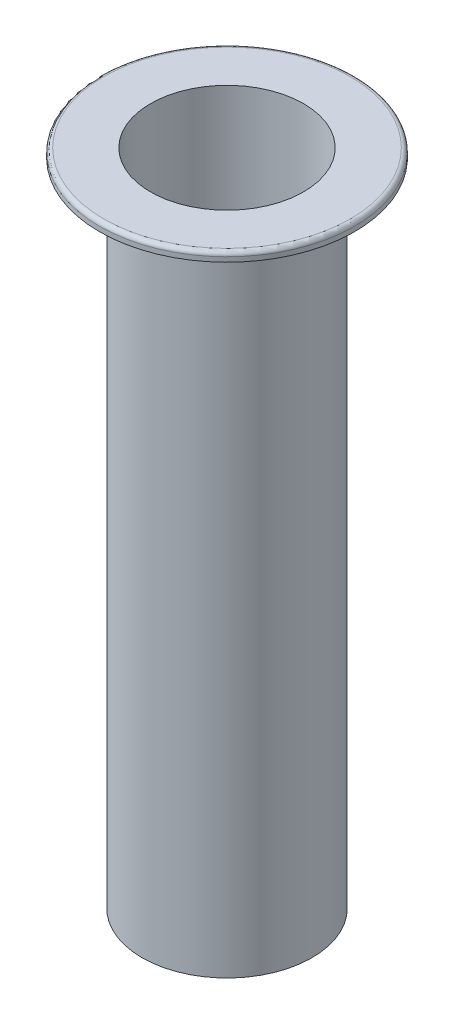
ISO-10303-21;
HEADER;
FILE_DESCRIPTION(('STEP AP214'),'2;1');
FILE_NAME('part.step','',(''),(''),'','','');
FILE_SCHEMA(('AUTOMOTIVE_DESIGN { 1 0 10303 214 1 1 1 1 }'));
ENDSEC;
DATA;
#1=APPLICATION_CONTEXT('core data for automotive mechanical design processes');
#2=APPLICATION_PROTOCOL_DEFINITION('international standard','automotive_design',2000,#1);
#3=PRODUCT_CONTEXT('',#1,'mechanical');
#4=PRODUCT('Part','Part','',(#3));
#5=PRODUCT_RELATED_PRODUCT_CATEGORY('part','',(#4));
#6=PRODUCT_DEFINITION_FORMATION('','',#4);
#7=PRODUCT_DEFINITION_CONTEXT('part definition',#1,'design');
#8=PRODUCT_DEFINITION('design','',#6,#7);
#9=PRODUCT_DEFINITION_SHAPE('','',#8);
#10=(LENGTH_UNIT() NAMED_UNIT(*) SI_UNIT(.MILLI.,.METRE.));
#11=(NAMED_UNIT(*) PLANE_ANGLE_UNIT() SI_UNIT($,.RADIAN.));
#12=(NAMED_UNIT(*) SI_UNIT($,.STERADIAN.) SOLID_ANGLE_UNIT());
#13=UNCERTAINTY_MEASURE_WITH_UNIT(LENGTH_MEASURE(1.E-05),#10,'distance_accuracy_value','');
#14=(GEOMETRIC_REPRESENTATION_CONTEXT(3) GLOBAL_UNCERTAINTY_ASSIGNED_CONTEXT((#13)) GLOBAL_UNIT_ASSIGNED_CONTEXT((#10,
#11,#12)) REPRESENTATION_CONTEXT('',''));
#15=CARTESIAN_POINT('',(0.,0.,0.));
#16=DIRECTION('',(0.,0.,1.));
#17=DIRECTION('',(1.,0.,0.));
#18=AXIS2_PLACEMENT_3D('',#15,#16,#17);
#19=CARTESIAN_POINT('',(0.,-150.,0.));
#20=DIRECTION('',(0.,1.,0.));
#21=DIRECTION('',(0.,0.,1.));
#22=AXIS2_PLACEMENT_3D('',#19,#20,#21);
#23=CYLINDRICAL_SURFACE('',#22,20.);
#24=CARTESIAN_POINT('',(0.,-150.,0.));
#25=DIRECTION('',(0.,1.,0.));
#26=DIRECTION('',(0.,0.,1.));
#27=AXIS2_PLACEMENT_3D('',#24,#25,#26);
#28=CIRCLE('',#27,20.);
#29=CARTESIAN_POINT('',(0.,-150.,20.));
#30=VERTEX_POINT('',#29);
#31=EDGE_CURVE('E52',#30,#30,#28,.T.);
#32=ORIENTED_EDGE('',*,*,#31,.T.);
#33=EDGE_LOOP('',(#32));
#34=FACE_BOUND('',#33,.T.);
#35=CARTESIAN_POINT('',(0.,0.,0.));
#36=DIRECTION('',(0.,1.,0.));
#37=DIRECTION('',(0.,0.,1.));
#38=AXIS2_PLACEMENT_3D('',#35,#36,#37);
#39=CIRCLE('',#38,20.);
#40=CARTESIAN_POINT('',(0.,0.,20.));
#41=VERTEX_POINT('',#40);
#42=EDGE_CURVE('E53',#41,#41,#39,.T.);
#43=ORIENTED_EDGE('',*,*,#42,.F.);
#44=EDGE_LOOP('',(#43));
#45=FACE_BOUND('',#44,.T.);
#46=ADVANCED_FACE('F32',(#34,#45),#23,.T.);
#47=CARTESIAN_POINT('',(0.,-150.,0.));
#48=DIRECTION('',(0.,1.,0.));
#49=DIRECTION('',(0.,0.,1.));
#50=AXIS2_PLACEMENT_3D('',#47,#48,#49);
#51=PLANE('',#50);
#52=CARTESIAN_POINT('',(0.,-150.,0.));
#53=DIRECTION('',(0.,-1.,0.));
#54=DIRECTION('',(0.,0.,-1.));
#55=AXIS2_PLACEMENT_3D('',#52,#53,#54);
#56=CIRCLE('',#55,18.);
#57=CARTESIAN_POINT('',(0.,-150.,-18.));
#58=VERTEX_POINT('',#57);
#59=EDGE_CURVE('E59',#58,#58,#56,.T.);
#60=ORIENTED_EDGE('',*,*,#59,.F.);
#61=EDGE_LOOP('',(#60));
#62=FACE_BOUND('',#61,.T.);
#63=ORIENTED_EDGE('',*,*,#31,.F.);
#64=EDGE_LOOP('',(#63));
#65=FACE_BOUND('',#64,.T.);
#66=ADVANCED_FACE('F75',(#62,#65),#51,.F.);
#67=CARTESIAN_POINT('',(0.,5.,0.));
#68=DIRECTION('',(0.,-1.,0.));
#69=DIRECTION('',(0.,0.,-1.));
#70=AXIS2_PLACEMENT_3D('',#67,#68,#69);
#71=CYLINDRICAL_SURFACE('',#70,30.);
#72=CARTESIAN_POINT('',(0.,4.,0.));
#73=DIRECTION('',(0.,1.,0.));
#74=DIRECTION('',(0.,0.,1.));
#75=AXIS2_PLACEMENT_3D('',#72,#73,#74);
#76=CIRCLE('',#75,30.);
#77=CARTESIAN_POINT('',(0.,4.,30.));
#78=VERTEX_POINT('',#77);
#79=EDGE_CURVE('E10',#78,#78,#76,.F.);
#80=ORIENTED_EDGE('',*,*,#79,.T.);
#81=EDGE_LOOP('',(#80));
#82=FACE_BOUND('',#81,.T.);
#83=CARTESIAN_POINT('',(0.,2.88675134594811,0.));
#84=DIRECTION('',(0.,1.,0.));
#85=DIRECTION('',(0.,0.,1.));
#86=AXIS2_PLACEMENT_3D('',#83,#84,#85);
#87=CIRCLE('',#86,30.);
#88=CARTESIAN_POINT('',(0.,2.88675134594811,30.));
#89=VERTEX_POINT('',#88);
#90=EDGE_CURVE('E47',#89,#89,#87,.T.);
#91=ORIENTED_EDGE('',*,*,#90,.T.);
#92=EDGE_LOOP('',(#91));
#93=FACE_BOUND('',#92,.T.);
#94=ADVANCED_FACE('F78',(#82,#93),#71,.T.);
#95=CARTESIAN_POINT('',(0.,5.,0.));
#96=DIRECTION('',(0.,1.,0.));
#97=DIRECTION('',(0.,0.,1.));
#98=AXIS2_PLACEMENT_3D('',#95,#96,#97);
#99=PLANE('',#98);
#100=CARTESIAN_POINT('',(0.,5.,0.));
#101=DIRECTION('',(0.,1.,0.));
#102=DIRECTION('',(0.,0.,1.));
#103=AXIS2_PLACEMENT_3D('',#100,#101,#102);
#104=CIRCLE('',#103,29.);
#105=CARTESIAN_POINT('',(0.,5.,29.));
#106=VERTEX_POINT('',#105);
#107=EDGE_CURVE('E39',#106,#106,#104,.T.);
#108=ORIENTED_EDGE('',*,*,#107,.T.);
#109=EDGE_LOOP('',(#108));
#110=FACE_BOUND('',#109,.T.);
#111=CARTESIAN_POINT('',(0.,5.,0.));
#112=DIRECTION('',(0.,-1.,0.));
#113=DIRECTION('',(0.,0.,-1.));
#114=AXIS2_PLACEMENT_3D('',#111,#112,#113);
#115=CIRCLE('',#114,18.);
#116=CARTESIAN_POINT('',(0.,5.,-18.));
#117=VERTEX_POINT('',#116);
#118=EDGE_CURVE('E56',#117,#117,#115,.T.);
#119=ORIENTED_EDGE('',*,*,#118,.T.);
#120=EDGE_LOOP('',(#119));
#121=FACE_BOUND('',#120,.T.);
#122=ADVANCED_FACE('F65',(#110,#121),#99,.T.);
#123=CARTESIAN_POINT('',(0.,0.,0.));
#124=DIRECTION('',(0.,1.,0.));
#125=DIRECTION('',(0.,0.,1.));
#126=AXIS2_PLACEMENT_3D('',#123,#124,#125);
#127=PLANE('',#126);
#128=CARTESIAN_POINT('',(0.,0.,0.));
#129=DIRECTION('',(0.,1.,0.));
#130=DIRECTION('',(0.,0.,1.));
#131=AXIS2_PLACEMENT_3D('',#128,#129,#130);
#132=CIRCLE('',#131,25.);
#133=CARTESIAN_POINT('',(0.,0.,25.));
#134=VERTEX_POINT('',#133);
#135=EDGE_CURVE('E43',#134,#134,#132,.F.);
#136=ORIENTED_EDGE('',*,*,#135,.T.);
#137=EDGE_LOOP('',(#136));
#138=FACE_BOUND('',#137,.T.);
#139=ORIENTED_EDGE('',*,*,#42,.T.);
#140=EDGE_LOOP('',(#139));
#141=FACE_BOUND('',#140,.T.);
#142=ADVANCED_FACE('F71',(#138,#141),#127,.F.);
#143=CARTESIAN_POINT('',(0.,5.,0.));
#144=DIRECTION('',(0.,-1.,0.));
#145=DIRECTION('',(0.,0.,-1.));
#146=AXIS2_PLACEMENT_3D('',#143,#144,#145);
#147=CYLINDRICAL_SURFACE('',#146,18.);
#148=ORIENTED_EDGE('',*,*,#118,.F.);
#149=EDGE_LOOP('',(#148));
#150=FACE_BOUND('',#149,.T.);
#151=ORIENTED_EDGE('',*,*,#59,.T.);
#152=EDGE_LOOP('',(#151));
#153=FACE_BOUND('',#152,.T.);
#154=ADVANCED_FACE('F67',(#150,#153),#147,.F.);
#155=CARTESIAN_POINT('',(0.,2.88675134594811,0.));
#156=DIRECTION('',(0.,1.,0.));
#157=DIRECTION('',(0.,0.,1.));
#158=AXIS2_PLACEMENT_3D('',#155,#156,#157);
#159=CONICAL_SURFACE('',#158,30.,1.0471975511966);
#160=ORIENTED_EDGE('',*,*,#135,.F.);
#161=EDGE_LOOP('',(#160));
#162=FACE_BOUND('',#161,.T.);
#163=ORIENTED_EDGE('',*,*,#90,.F.);
#164=EDGE_LOOP('',(#163));
#165=FACE_BOUND('',#164,.T.);
#166=ADVANCED_FACE('F70',(#162,#165),#159,.T.);
#167=CARTESIAN_POINT('',(0.,4.,0.));
#168=DIRECTION('',(0.,1.,0.));
#169=DIRECTION('',(0.,0.,1.));
#170=AXIS2_PLACEMENT_3D('',#167,#168,#169);
#171=TOROIDAL_SURFACE('',#170,29.,1.);
#172=ORIENTED_EDGE('',*,*,#79,.F.);
#173=EDGE_LOOP('',(#172));
#174=FACE_BOUND('',#173,.T.);
#175=ORIENTED_EDGE('',*,*,#107,.F.);
#176=EDGE_LOOP('',(#175));
#177=FACE_BOUND('',#176,.T.);
#178=ADVANCED_FACE('F34',(#174,#177),#171,.T.);
#179=CLOSED_SHELL('',(#46,#66,#94,#122,#142,#154,#166,#178));
#180=MANIFOLD_SOLID_BREP('B2',#179);
#181=ADVANCED_BREP_SHAPE_REPRESENTATION('',(#18,#180),#14);
#182=SHAPE_DEFINITION_REPRESENTATION(#9,#181);
ENDSEC;
END-ISO-10303-21;
